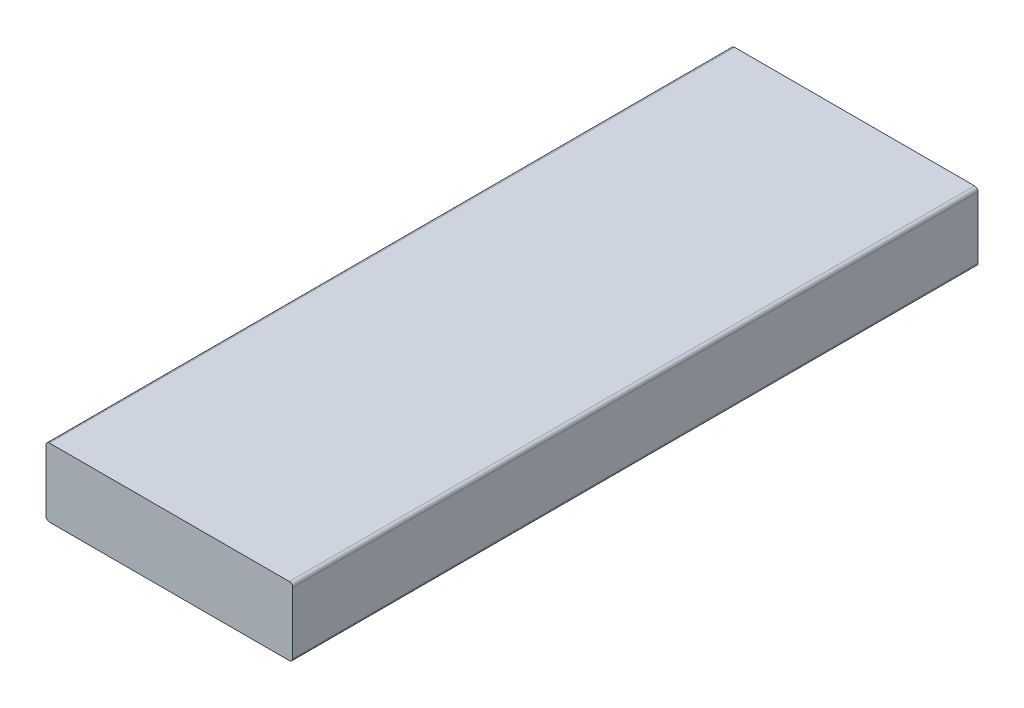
ISO-10303-21;
HEADER;
FILE_DESCRIPTION(('STEP AP214'),'2;1');
FILE_NAME('part.step','',(''),(''),'','','');
FILE_SCHEMA(('AUTOMOTIVE_DESIGN { 1 0 10303 214 1 1 1 1 }'));
ENDSEC;
DATA;
#1=APPLICATION_CONTEXT('core data for automotive mechanical design processes');
#2=APPLICATION_PROTOCOL_DEFINITION('international standard','automotive_design',2000,#1);
#3=PRODUCT_CONTEXT('',#1,'mechanical');
#4=PRODUCT('Part','Part','',(#3));
#5=PRODUCT_RELATED_PRODUCT_CATEGORY('part','',(#4));
#6=PRODUCT_DEFINITION_FORMATION('','',#4);
#7=PRODUCT_DEFINITION_CONTEXT('part definition',#1,'design');
#8=PRODUCT_DEFINITION('design','',#6,#7);
#9=PRODUCT_DEFINITION_SHAPE('','',#8);
#10=(LENGTH_UNIT() NAMED_UNIT(*) SI_UNIT(.MILLI.,.METRE.));
#11=(NAMED_UNIT(*) PLANE_ANGLE_UNIT() SI_UNIT($,.RADIAN.));
#12=(NAMED_UNIT(*) SI_UNIT($,.STERADIAN.) SOLID_ANGLE_UNIT());
#13=UNCERTAINTY_MEASURE_WITH_UNIT(LENGTH_MEASURE(1.E-05),#10,'distance_accuracy_value','');
#14=(GEOMETRIC_REPRESENTATION_CONTEXT(3) GLOBAL_UNCERTAINTY_ASSIGNED_CONTEXT((#13)) GLOBAL_UNIT_ASSIGNED_CONTEXT((#10,
#11,#12)) REPRESENTATION_CONTEXT('',''));
#15=CARTESIAN_POINT('',(0.,0.,0.));
#16=DIRECTION('',(0.,0.,1.));
#17=DIRECTION('',(1.,0.,0.));
#18=AXIS2_PLACEMENT_3D('',#15,#16,#17);
#19=CARTESIAN_POINT('',(10.8,-3.,60.));
#20=DIRECTION('',(-1.,0.,0.));
#21=DIRECTION('',(0.,0.,1.));
#22=AXIS2_PLACEMENT_3D('',#19,#20,#21);
#23=PLANE('',#22);
#24=DIRECTION('',(0.,1.,0.));
#25=VECTOR('',#24,1.);
#26=CARTESIAN_POINT('',(10.8,-3.,0.));
#27=LINE('',#26,#25);
#28=CARTESIAN_POINT('',(10.8,-2.7,0.));
#29=VERTEX_POINT('',#28);
#30=CARTESIAN_POINT('',(10.8,2.7,0.));
#31=VERTEX_POINT('',#30);
#32=EDGE_CURVE('E136',#29,#31,#27,.T.);
#33=ORIENTED_EDGE('',*,*,#32,.T.);
#34=DIRECTION('',(0.,0.,-1.));
#35=VECTOR('',#34,1.);
#36=CARTESIAN_POINT('',(10.8,2.7,60.));
#37=LINE('',#36,#35);
#38=CARTESIAN_POINT('',(10.8,2.7,60.));
#39=VERTEX_POINT('',#38);
#40=EDGE_CURVE('E111',#31,#39,#37,.F.);
#41=ORIENTED_EDGE('',*,*,#40,.T.);
#42=DIRECTION('',(0.,1.,0.));
#43=VECTOR('',#42,1.);
#44=CARTESIAN_POINT('',(10.8,-3.,60.));
#45=LINE('',#44,#43);
#46=CARTESIAN_POINT('',(10.8,-2.7,60.));
#47=VERTEX_POINT('',#46);
#48=EDGE_CURVE('E148',#47,#39,#45,.T.);
#49=ORIENTED_EDGE('',*,*,#48,.F.);
#50=DIRECTION('',(0.,0.,-1.));
#51=VECTOR('',#50,1.);
#52=CARTESIAN_POINT('',(10.8,-2.7,60.));
#53=LINE('',#52,#51);
#54=EDGE_CURVE('E117',#47,#29,#53,.T.);
#55=ORIENTED_EDGE('',*,*,#54,.T.);
#56=EDGE_LOOP('',(#33,#41,#49,#55));
#57=FACE_BOUND('',#56,.T.);
#58=ADVANCED_FACE('F39',(#57),#23,.F.);
#59=CARTESIAN_POINT('',(-10.8,3.,60.));
#60=DIRECTION('',(0.,-1.,0.));
#61=DIRECTION('',(0.,0.,-1.));
#62=AXIS2_PLACEMENT_3D('',#59,#60,#61);
#63=PLANE('',#62);
#64=DIRECTION('',(-1.,0.,0.));
#65=VECTOR('',#64,1.);
#66=CARTESIAN_POINT('',(-10.8,3.,60.));
#67=LINE('',#66,#65);
#68=CARTESIAN_POINT('',(10.5,3.,60.));
#69=VERTEX_POINT('',#68);
#70=CARTESIAN_POINT('',(-10.5,3.,60.));
#71=VERTEX_POINT('',#70);
#72=EDGE_CURVE('E127',#69,#71,#67,.T.);
#73=ORIENTED_EDGE('',*,*,#72,.F.);
#74=DIRECTION('',(0.,0.,-1.));
#75=VECTOR('',#74,1.);
#76=CARTESIAN_POINT('',(10.5,3.,60.));
#77=LINE('',#76,#75);
#78=CARTESIAN_POINT('',(10.5,3.,0.));
#79=VERTEX_POINT('',#78);
#80=EDGE_CURVE('E110',#69,#79,#77,.T.);
#81=ORIENTED_EDGE('',*,*,#80,.T.);
#82=DIRECTION('',(-1.,0.,0.));
#83=VECTOR('',#82,1.);
#84=CARTESIAN_POINT('',(-10.8,3.,0.));
#85=LINE('',#84,#83);
#86=CARTESIAN_POINT('',(-10.5,3.,0.));
#87=VERTEX_POINT('',#86);
#88=EDGE_CURVE('E124',#79,#87,#85,.T.);
#89=ORIENTED_EDGE('',*,*,#88,.T.);
#90=DIRECTION('',(0.,0.,-1.));
#91=VECTOR('',#90,1.);
#92=CARTESIAN_POINT('',(-10.5,3.,60.));
#93=LINE('',#92,#91);
#94=EDGE_CURVE('E130',#87,#71,#93,.F.);
#95=ORIENTED_EDGE('',*,*,#94,.T.);
#96=EDGE_LOOP('',(#73,#81,#89,#95));
#97=FACE_BOUND('',#96,.T.);
#98=ADVANCED_FACE('F123',(#97),#63,.F.);
#99=CARTESIAN_POINT('',(-10.8,-3.,60.));
#100=DIRECTION('',(1.,0.,0.));
#101=DIRECTION('',(0.,0.,-1.));
#102=AXIS2_PLACEMENT_3D('',#99,#100,#101);
#103=PLANE('',#102);
#104=DIRECTION('',(0.,-1.,0.));
#105=VECTOR('',#104,1.);
#106=CARTESIAN_POINT('',(-10.8,-3.,0.));
#107=LINE('',#106,#105);
#108=CARTESIAN_POINT('',(-10.8,2.7,0.));
#109=VERTEX_POINT('',#108);
#110=CARTESIAN_POINT('',(-10.8,-2.7,0.));
#111=VERTEX_POINT('',#110);
#112=EDGE_CURVE('E135',#109,#111,#107,.T.);
#113=ORIENTED_EDGE('',*,*,#112,.T.);
#114=DIRECTION('',(0.,0.,-1.));
#115=VECTOR('',#114,1.);
#116=CARTESIAN_POINT('',(-10.8,-2.7,60.));
#117=LINE('',#116,#115);
#118=CARTESIAN_POINT('',(-10.8,-2.7,60.));
#119=VERTEX_POINT('',#118);
#120=EDGE_CURVE('E11',#111,#119,#117,.F.);
#121=ORIENTED_EDGE('',*,*,#120,.T.);
#122=DIRECTION('',(0.,-1.,0.));
#123=VECTOR('',#122,1.);
#124=CARTESIAN_POINT('',(-10.8,-3.,60.));
#125=LINE('',#124,#123);
#126=CARTESIAN_POINT('',(-10.8,2.7,60.));
#127=VERTEX_POINT('',#126);
#128=EDGE_CURVE('E187',#127,#119,#125,.T.);
#129=ORIENTED_EDGE('',*,*,#128,.F.);
#130=DIRECTION('',(0.,0.,-1.));
#131=VECTOR('',#130,1.);
#132=CARTESIAN_POINT('',(-10.8,2.7,60.));
#133=LINE('',#132,#131);
#134=EDGE_CURVE('E48',#127,#109,#133,.T.);
#135=ORIENTED_EDGE('',*,*,#134,.T.);
#136=EDGE_LOOP('',(#113,#121,#129,#135));
#137=FACE_BOUND('',#136,.T.);
#138=ADVANCED_FACE('F185',(#137),#103,.F.);
#139=CARTESIAN_POINT('',(-10.8,-3.,60.));
#140=DIRECTION('',(0.,1.,0.));
#141=DIRECTION('',(0.,0.,1.));
#142=AXIS2_PLACEMENT_3D('',#139,#140,#141);
#143=PLANE('',#142);
#144=DIRECTION('',(1.,0.,0.));
#145=VECTOR('',#144,1.);
#146=CARTESIAN_POINT('',(-10.8,-3.,0.));
#147=LINE('',#146,#145);
#148=CARTESIAN_POINT('',(-10.5,-3.,0.));
#149=VERTEX_POINT('',#148);
#150=CARTESIAN_POINT('',(10.5,-3.,0.));
#151=VERTEX_POINT('',#150);
#152=EDGE_CURVE('E141',#149,#151,#147,.T.);
#153=ORIENTED_EDGE('',*,*,#152,.T.);
#154=DIRECTION('',(0.,0.,-1.));
#155=VECTOR('',#154,1.);
#156=CARTESIAN_POINT('',(10.5,-3.,60.));
#157=LINE('',#156,#155);
#158=CARTESIAN_POINT('',(10.5,-3.,60.));
#159=VERTEX_POINT('',#158);
#160=EDGE_CURVE('E55',#151,#159,#157,.F.);
#161=ORIENTED_EDGE('',*,*,#160,.T.);
#162=DIRECTION('',(1.,0.,0.));
#163=VECTOR('',#162,1.);
#164=CARTESIAN_POINT('',(-10.8,-3.,60.));
#165=LINE('',#164,#163);
#166=CARTESIAN_POINT('',(-10.5,-3.,60.));
#167=VERTEX_POINT('',#166);
#168=EDGE_CURVE('E150',#167,#159,#165,.T.);
#169=ORIENTED_EDGE('',*,*,#168,.F.);
#170=DIRECTION('',(0.,0.,-1.));
#171=VECTOR('',#170,1.);
#172=CARTESIAN_POINT('',(-10.5,-3.,60.));
#173=LINE('',#172,#171);
#174=EDGE_CURVE('E175',#167,#149,#173,.T.);
#175=ORIENTED_EDGE('',*,*,#174,.T.);
#176=EDGE_LOOP('',(#153,#161,#169,#175));
#177=FACE_BOUND('',#176,.T.);
#178=ADVANCED_FACE('F194',(#177),#143,.F.);
#179=CARTESIAN_POINT('',(0.,0.,60.));
#180=DIRECTION('',(0.,0.,-1.));
#181=DIRECTION('',(-1.,0.,0.));
#182=AXIS2_PLACEMENT_3D('',#179,#180,#181);
#183=PLANE('',#182);
#184=ORIENTED_EDGE('',*,*,#48,.T.);
#185=CARTESIAN_POINT('',(10.5,2.7,60.));
#186=DIRECTION('',(0.,0.,-1.));
#187=DIRECTION('',(-1.,0.,0.));
#188=AXIS2_PLACEMENT_3D('',#185,#186,#187);
#189=CIRCLE('',#188,0.3);
#190=EDGE_CURVE('E172',#39,#69,#189,.F.);
#191=ORIENTED_EDGE('',*,*,#190,.T.);
#192=ORIENTED_EDGE('',*,*,#72,.T.);
#193=CARTESIAN_POINT('',(-10.5,2.7,60.));
#194=DIRECTION('',(0.,0.,-1.));
#195=DIRECTION('',(-1.,0.,0.));
#196=AXIS2_PLACEMENT_3D('',#193,#194,#195);
#197=CIRCLE('',#196,0.3);
#198=EDGE_CURVE('E164',#71,#127,#197,.F.);
#199=ORIENTED_EDGE('',*,*,#198,.T.);
#200=ORIENTED_EDGE('',*,*,#128,.T.);
#201=CARTESIAN_POINT('',(-10.5,-2.7,60.));
#202=DIRECTION('',(0.,0.,-1.));
#203=DIRECTION('',(-1.,0.,0.));
#204=AXIS2_PLACEMENT_3D('',#201,#202,#203);
#205=CIRCLE('',#204,0.3);
#206=EDGE_CURVE('E62',#119,#167,#205,.F.);
#207=ORIENTED_EDGE('',*,*,#206,.T.);
#208=ORIENTED_EDGE('',*,*,#168,.T.);
#209=CARTESIAN_POINT('',(10.5,-2.7,60.));
#210=DIRECTION('',(0.,0.,-1.));
#211=DIRECTION('',(-1.,0.,0.));
#212=AXIS2_PLACEMENT_3D('',#209,#210,#211);
#213=CIRCLE('',#212,0.3);
#214=EDGE_CURVE('E169',#159,#47,#213,.F.);
#215=ORIENTED_EDGE('',*,*,#214,.T.);
#216=EDGE_LOOP('',(#184,#191,#192,#199,#200,#207,#208,#215));
#217=FACE_BOUND('',#216,.T.);
#218=ADVANCED_FACE('F205',(#217),#183,.F.);
#219=CARTESIAN_POINT('',(0.,0.,0.));
#220=DIRECTION('',(0.,0.,-1.));
#221=DIRECTION('',(-1.,0.,0.));
#222=AXIS2_PLACEMENT_3D('',#219,#220,#221);
#223=PLANE('',#222);
#224=ORIENTED_EDGE('',*,*,#88,.F.);
#225=CARTESIAN_POINT('',(10.5,2.7,0.));
#226=DIRECTION('',(0.,0.,-1.));
#227=DIRECTION('',(-1.,0.,0.));
#228=AXIS2_PLACEMENT_3D('',#225,#226,#227);
#229=CIRCLE('',#228,0.3);
#230=EDGE_CURVE('E106',#79,#31,#229,.T.);
#231=ORIENTED_EDGE('',*,*,#230,.T.);
#232=ORIENTED_EDGE('',*,*,#32,.F.);
#233=CARTESIAN_POINT('',(10.5,-2.7,0.));
#234=DIRECTION('',(0.,0.,-1.));
#235=DIRECTION('',(-1.,0.,0.));
#236=AXIS2_PLACEMENT_3D('',#233,#234,#235);
#237=CIRCLE('',#236,0.3);
#238=EDGE_CURVE('E118',#29,#151,#237,.T.);
#239=ORIENTED_EDGE('',*,*,#238,.T.);
#240=ORIENTED_EDGE('',*,*,#152,.F.);
#241=CARTESIAN_POINT('',(-10.5,-2.7,0.));
#242=DIRECTION('',(0.,0.,-1.));
#243=DIRECTION('',(-1.,0.,0.));
#244=AXIS2_PLACEMENT_3D('',#241,#242,#243);
#245=CIRCLE('',#244,0.3);
#246=EDGE_CURVE('E154',#149,#111,#245,.T.);
#247=ORIENTED_EDGE('',*,*,#246,.T.);
#248=ORIENTED_EDGE('',*,*,#112,.F.);
#249=CARTESIAN_POINT('',(-10.5,2.7,0.));
#250=DIRECTION('',(0.,0.,-1.));
#251=DIRECTION('',(-1.,0.,0.));
#252=AXIS2_PLACEMENT_3D('',#249,#250,#251);
#253=CIRCLE('',#252,0.3);
#254=EDGE_CURVE('E129',#109,#87,#253,.T.);
#255=ORIENTED_EDGE('',*,*,#254,.T.);
#256=EDGE_LOOP('',(#224,#231,#232,#239,#240,#247,#248,#255));
#257=FACE_BOUND('',#256,.T.);
#258=ADVANCED_FACE('F132',(#257),#223,.T.);
#259=CARTESIAN_POINT('',(10.5,2.7,60.));
#260=DIRECTION('',(0.,0.,-1.));
#261=DIRECTION('',(-1.,0.,0.));
#262=AXIS2_PLACEMENT_3D('',#259,#260,#261);
#263=CYLINDRICAL_SURFACE('',#262,0.3);
#264=ORIENTED_EDGE('',*,*,#190,.F.);
#265=ORIENTED_EDGE('',*,*,#40,.F.);
#266=ORIENTED_EDGE('',*,*,#230,.F.);
#267=ORIENTED_EDGE('',*,*,#80,.F.);
#268=EDGE_LOOP('',(#264,#265,#266,#267));
#269=FACE_BOUND('',#268,.T.);
#270=ADVANCED_FACE('F109',(#269),#263,.T.);
#271=CARTESIAN_POINT('',(10.5,-2.7,60.));
#272=DIRECTION('',(0.,0.,-1.));
#273=DIRECTION('',(-1.,0.,0.));
#274=AXIS2_PLACEMENT_3D('',#271,#272,#273);
#275=CYLINDRICAL_SURFACE('',#274,0.3);
#276=ORIENTED_EDGE('',*,*,#214,.F.);
#277=ORIENTED_EDGE('',*,*,#160,.F.);
#278=ORIENTED_EDGE('',*,*,#238,.F.);
#279=ORIENTED_EDGE('',*,*,#54,.F.);
#280=EDGE_LOOP('',(#276,#277,#278,#279));
#281=FACE_BOUND('',#280,.T.);
#282=ADVANCED_FACE('F209',(#281),#275,.T.);
#283=CARTESIAN_POINT('',(-10.5,-2.7,60.));
#284=DIRECTION('',(0.,0.,-1.));
#285=DIRECTION('',(-1.,0.,0.));
#286=AXIS2_PLACEMENT_3D('',#283,#284,#285);
#287=CYLINDRICAL_SURFACE('',#286,0.3);
#288=ORIENTED_EDGE('',*,*,#206,.F.);
#289=ORIENTED_EDGE('',*,*,#120,.F.);
#290=ORIENTED_EDGE('',*,*,#246,.F.);
#291=ORIENTED_EDGE('',*,*,#174,.F.);
#292=EDGE_LOOP('',(#288,#289,#290,#291));
#293=FACE_BOUND('',#292,.T.);
#294=ADVANCED_FACE('F193',(#293),#287,.T.);
#295=CARTESIAN_POINT('',(-10.5,2.7,60.));
#296=DIRECTION('',(0.,0.,-1.));
#297=DIRECTION('',(-1.,0.,0.));
#298=AXIS2_PLACEMENT_3D('',#295,#296,#297);
#299=CYLINDRICAL_SURFACE('',#298,0.3);
#300=ORIENTED_EDGE('',*,*,#198,.F.);
#301=ORIENTED_EDGE('',*,*,#94,.F.);
#302=ORIENTED_EDGE('',*,*,#254,.F.);
#303=ORIENTED_EDGE('',*,*,#134,.F.);
#304=EDGE_LOOP('',(#300,#301,#302,#303));
#305=FACE_BOUND('',#304,.T.);
#306=ADVANCED_FACE('F41',(#305),#299,.T.);
#307=CLOSED_SHELL('',(#58,#98,#138,#178,#218,#258,#270,#282,#294,#306));
#308=MANIFOLD_SOLID_BREP('B2',#307);
#309=ADVANCED_BREP_SHAPE_REPRESENTATION('',(#18,#308),#14);
#310=SHAPE_DEFINITION_REPRESENTATION(#9,#309);
ENDSEC;
END-ISO-10303-21;
